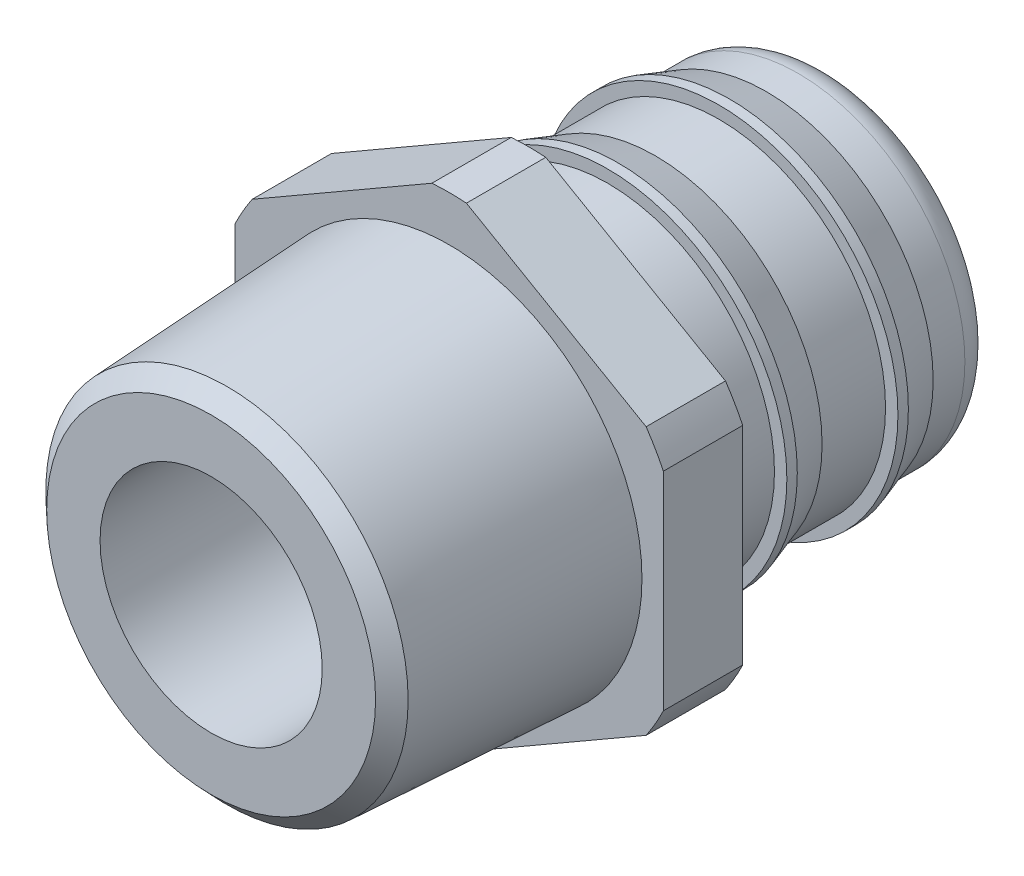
from build123d import *

# Parameters (mm, degrees)
ENL_V_MAT_EXTRU_1_DEPTH = 30.154759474


with BuildPart() as part:
    # Esquisse1 → R_volution1 (revolve)
    with BuildSketch(Plane(origin=(0, 0, 0), x_dir=(0, 0, -1), z_dir=(1, 0, 0)), mode=Mode.PRIVATE) as r_volution1_sk:
        with BuildLine():
            Line((10, 7), (10, 10.363883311))
            Line((10, 10.363883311), (10.998629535, 11.416219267))
            Line((10.998629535, 11.416219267), (25, 12.15))
            Line((25, 12.15), (25, 15))
            Line((25, 15), (30, 15))
            Line((30, 15), (30, 10.5))
            Line((30, 10.5), (35, 10.5))
            Line((35, 10.5), (35, 11.280628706))
            Line((35, 11.280628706), (35.658113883, 11.280628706))
            Line((35.658113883, 11.280628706), (38, 10.5))
            Line((38, 10.5), (42, 10.5))
            Line((42, 10.5), (42, 11.280628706))
            Line((42, 11.280628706), (42.658113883, 11.280628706))
            Line((42.658113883, 11.280628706), (45.000000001, 10.5))
            Line((45.000000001, 10.5), (47, 10.5))
            ThreePointArc((47, 10.5), (48.414213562, 9.914213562), (49, 8.5))
            Line((49, 8.5), (49, 7))
            Line((49, 7), (10, 7))
        make_face()
    revolve(r_volution1_sk.sketch.rotate(Axis((0, 0, 0), (0, 0, -1)), 90), axis=Axis((0, 0, 0), (0, 0, -1)))

    # Esquisse2 → Enl_v. mat.-Extru.1 (cut, through all)
    with BuildSketch(Plane(origin=(0, 0, -30), x_dir=(-1, 0, 0), z_dir=(0, 0, -1))):
        with BuildLine():
            Line((13.5, -6.538348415), (13.5, 6.538348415))
            ThreePointArc((13.5, 6.538348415), (15, 0), (13.5, -6.538348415))
        make_face()
        with BuildLine():
            Line((12.412375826, 8.422168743), (1.087624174, 14.960517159))
            ThreePointArc((1.087624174, 14.960517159), (7.5, 12.990381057), (12.412375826, 8.422168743))
        make_face()
        with BuildLine():
            Line((-1.087624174, 14.960517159), (-12.412375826, 8.422168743))
            ThreePointArc((-12.412375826, 8.422168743), (-7.5, 12.990381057), (-1.087624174, 14.960517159))
        make_face()
        with BuildLine():
            Line((-13.5, 6.538348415), (-13.5, -6.538348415))
            ThreePointArc((-13.5, -6.538348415), (-15, 0), (-13.5, 6.538348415))
        make_face()
        with BuildLine():
            Line((-12.412375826, -8.422168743), (-1.087624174, -14.960517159))
            ThreePointArc((-1.087624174, -14.960517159), (-7.5, -12.990381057), (-12.412375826, -8.422168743))
        make_face()
        with BuildLine():
            Line((1.087624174, -14.960517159), (12.412375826, -8.422168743))
            ThreePointArc((12.412375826, -8.422168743), (7.5, -12.990381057), (1.087624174, -14.960517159))
        make_face()
    extrude(amount=-ENL_V_MAT_EXTRU_1_DEPTH, mode=Mode.SUBTRACT)


solid = part.part
